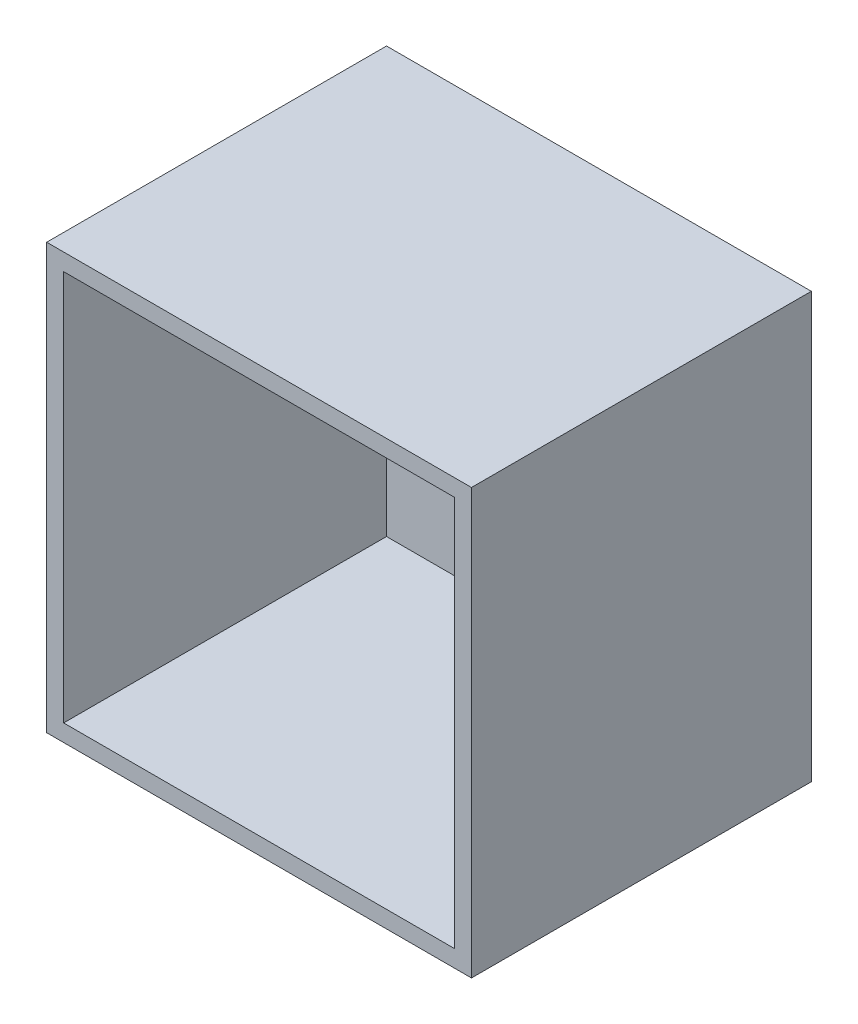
ISO-10303-21;
HEADER;
FILE_DESCRIPTION(('STEP AP214'),'2;1');
FILE_NAME('part.step','',(''),(''),'','','');
FILE_SCHEMA(('AUTOMOTIVE_DESIGN { 1 0 10303 214 1 1 1 1 }'));
ENDSEC;
DATA;
#1=APPLICATION_CONTEXT('core data for automotive mechanical design processes');
#2=APPLICATION_PROTOCOL_DEFINITION('international standard','automotive_design',2000,#1);
#3=PRODUCT_CONTEXT('',#1,'mechanical');
#4=PRODUCT('Part','Part','',(#3));
#5=PRODUCT_RELATED_PRODUCT_CATEGORY('part','',(#4));
#6=PRODUCT_DEFINITION_FORMATION('','',#4);
#7=PRODUCT_DEFINITION_CONTEXT('part definition',#1,'design');
#8=PRODUCT_DEFINITION('design','',#6,#7);
#9=PRODUCT_DEFINITION_SHAPE('','',#8);
#10=(LENGTH_UNIT() NAMED_UNIT(*) SI_UNIT(.MILLI.,.METRE.));
#11=(NAMED_UNIT(*) PLANE_ANGLE_UNIT() SI_UNIT($,.RADIAN.));
#12=(NAMED_UNIT(*) SI_UNIT($,.STERADIAN.) SOLID_ANGLE_UNIT());
#13=UNCERTAINTY_MEASURE_WITH_UNIT(LENGTH_MEASURE(1.E-05),#10,'distance_accuracy_value','');
#14=(GEOMETRIC_REPRESENTATION_CONTEXT(3) GLOBAL_UNCERTAINTY_ASSIGNED_CONTEXT((#13)) GLOBAL_UNIT_ASSIGNED_CONTEXT((#10,
#11,#12)) REPRESENTATION_CONTEXT('',''));
#15=CARTESIAN_POINT('',(0.,0.,0.));
#16=DIRECTION('',(0.,0.,1.));
#17=DIRECTION('',(1.,0.,0.));
#18=AXIS2_PLACEMENT_3D('',#15,#16,#17);
#19=CARTESIAN_POINT('',(-25.,-25.,40.));
#20=DIRECTION('',(1.,0.,0.));
#21=DIRECTION('',(0.,0.,-1.));
#22=AXIS2_PLACEMENT_3D('',#19,#20,#21);
#23=PLANE('',#22);
#24=DIRECTION('',(0.,-1.,0.));
#25=VECTOR('',#24,1.);
#26=CARTESIAN_POINT('',(-25.,-25.,0.));
#27=LINE('',#26,#25);
#28=CARTESIAN_POINT('',(-25.,25.,0.));
#29=VERTEX_POINT('',#28);
#30=CARTESIAN_POINT('',(-25.,-25.,0.));
#31=VERTEX_POINT('',#30);
#32=EDGE_CURVE('E146',#29,#31,#27,.T.);
#33=ORIENTED_EDGE('',*,*,#32,.T.);
#34=DIRECTION('',(0.,0.,-1.));
#35=VECTOR('',#34,1.);
#36=CARTESIAN_POINT('',(-25.,-25.,40.));
#37=LINE('',#36,#35);
#38=CARTESIAN_POINT('',(-25.,-25.,40.));
#39=VERTEX_POINT('',#38);
#40=EDGE_CURVE('E11',#39,#31,#37,.T.);
#41=ORIENTED_EDGE('',*,*,#40,.F.);
#42=DIRECTION('',(0.,-1.,0.));
#43=VECTOR('',#42,1.);
#44=CARTESIAN_POINT('',(-25.,-25.,40.));
#45=LINE('',#44,#43);
#46=CARTESIAN_POINT('',(-25.,25.,40.));
#47=VERTEX_POINT('',#46);
#48=EDGE_CURVE('E139',#47,#39,#45,.T.);
#49=ORIENTED_EDGE('',*,*,#48,.F.);
#50=DIRECTION('',(0.,0.,-1.));
#51=VECTOR('',#50,1.);
#52=CARTESIAN_POINT('',(-25.,25.,40.));
#53=LINE('',#52,#51);
#54=EDGE_CURVE('E145',#47,#29,#53,.T.);
#55=ORIENTED_EDGE('',*,*,#54,.T.);
#56=EDGE_LOOP('',(#33,#41,#49,#55));
#57=FACE_BOUND('',#56,.T.);
#58=ADVANCED_FACE('F32',(#57),#23,.F.);
#59=CARTESIAN_POINT('',(25.,-25.,40.));
#60=DIRECTION('',(0.,1.,0.));
#61=DIRECTION('',(-1.,0.,0.));
#62=AXIS2_PLACEMENT_3D('',#59,#60,#61);
#63=PLANE('',#62);
#64=DIRECTION('',(1.,0.,0.));
#65=VECTOR('',#64,1.);
#66=CARTESIAN_POINT('',(25.,-25.,0.));
#67=LINE('',#66,#65);
#68=CARTESIAN_POINT('',(25.,-25.,0.));
#69=VERTEX_POINT('',#68);
#70=EDGE_CURVE('E149',#31,#69,#67,.T.);
#71=ORIENTED_EDGE('',*,*,#70,.T.);
#72=DIRECTION('',(0.,0.,-1.));
#73=VECTOR('',#72,1.);
#74=CARTESIAN_POINT('',(25.,-25.,40.));
#75=LINE('',#74,#73);
#76=CARTESIAN_POINT('',(25.,-25.,40.));
#77=VERTEX_POINT('',#76);
#78=EDGE_CURVE('E39',#77,#69,#75,.T.);
#79=ORIENTED_EDGE('',*,*,#78,.F.);
#80=DIRECTION('',(1.,0.,0.));
#81=VECTOR('',#80,1.);
#82=CARTESIAN_POINT('',(25.,-25.,40.));
#83=LINE('',#82,#81);
#84=EDGE_CURVE('E83',#39,#77,#83,.T.);
#85=ORIENTED_EDGE('',*,*,#84,.F.);
#86=ORIENTED_EDGE('',*,*,#40,.T.);
#87=EDGE_LOOP('',(#71,#79,#85,#86));
#88=FACE_BOUND('',#87,.T.);
#89=ADVANCED_FACE('F178',(#88),#63,.F.);
#90=CARTESIAN_POINT('',(25.,-25.,40.));
#91=DIRECTION('',(-1.,0.,0.));
#92=DIRECTION('',(0.,0.,1.));
#93=AXIS2_PLACEMENT_3D('',#90,#91,#92);
#94=PLANE('',#93);
#95=DIRECTION('',(0.,1.,0.));
#96=VECTOR('',#95,1.);
#97=CARTESIAN_POINT('',(25.,-25.,0.));
#98=LINE('',#97,#96);
#99=CARTESIAN_POINT('',(25.,25.,0.));
#100=VERTEX_POINT('',#99);
#101=EDGE_CURVE('E151',#69,#100,#98,.T.);
#102=ORIENTED_EDGE('',*,*,#101,.T.);
#103=DIRECTION('',(0.,0.,-1.));
#104=VECTOR('',#103,1.);
#105=CARTESIAN_POINT('',(25.,25.,40.));
#106=LINE('',#105,#104);
#107=CARTESIAN_POINT('',(25.,25.,40.));
#108=VERTEX_POINT('',#107);
#109=EDGE_CURVE('E155',#108,#100,#106,.T.);
#110=ORIENTED_EDGE('',*,*,#109,.F.);
#111=DIRECTION('',(0.,1.,0.));
#112=VECTOR('',#111,1.);
#113=CARTESIAN_POINT('',(25.,-25.,40.));
#114=LINE('',#113,#112);
#115=EDGE_CURVE('E142',#77,#108,#114,.T.);
#116=ORIENTED_EDGE('',*,*,#115,.F.);
#117=ORIENTED_EDGE('',*,*,#78,.T.);
#118=EDGE_LOOP('',(#102,#110,#116,#117));
#119=FACE_BOUND('',#118,.T.);
#120=ADVANCED_FACE('F160',(#119),#94,.F.);
#121=CARTESIAN_POINT('',(25.,25.,40.));
#122=DIRECTION('',(0.,-1.,0.));
#123=DIRECTION('',(1.,0.,0.));
#124=AXIS2_PLACEMENT_3D('',#121,#122,#123);
#125=PLANE('',#124);
#126=DIRECTION('',(-1.,0.,0.));
#127=VECTOR('',#126,1.);
#128=CARTESIAN_POINT('',(25.,25.,0.));
#129=LINE('',#128,#127);
#130=EDGE_CURVE('E76',#100,#29,#129,.T.);
#131=ORIENTED_EDGE('',*,*,#130,.T.);
#132=ORIENTED_EDGE('',*,*,#54,.F.);
#133=DIRECTION('',(-1.,0.,0.));
#134=VECTOR('',#133,1.);
#135=CARTESIAN_POINT('',(25.,25.,40.));
#136=LINE('',#135,#134);
#137=EDGE_CURVE('E55',#108,#47,#136,.T.);
#138=ORIENTED_EDGE('',*,*,#137,.F.);
#139=ORIENTED_EDGE('',*,*,#109,.T.);
#140=EDGE_LOOP('',(#131,#132,#138,#139));
#141=FACE_BOUND('',#140,.T.);
#142=ADVANCED_FACE('F168',(#141),#125,.F.);
#143=CARTESIAN_POINT('',(0.,0.,40.));
#144=DIRECTION('',(0.,0.,1.));
#145=DIRECTION('',(1.,0.,0.));
#146=AXIS2_PLACEMENT_3D('',#143,#144,#145);
#147=PLANE('',#146);
#148=DIRECTION('',(0.,-1.,0.));
#149=VECTOR('',#148,1.);
#150=CARTESIAN_POINT('',(-23.,-25.,40.));
#151=LINE('',#150,#149);
#152=CARTESIAN_POINT('',(-23.,23.,40.));
#153=VERTEX_POINT('',#152);
#154=CARTESIAN_POINT('',(-23.,-23.,40.));
#155=VERTEX_POINT('',#154);
#156=EDGE_CURVE('E128',#153,#155,#151,.T.);
#157=ORIENTED_EDGE('',*,*,#156,.F.);
#158=DIRECTION('',(-1.,0.,0.));
#159=VECTOR('',#158,1.);
#160=CARTESIAN_POINT('',(25.,23.,40.));
#161=LINE('',#160,#159);
#162=CARTESIAN_POINT('',(23.,23.,40.));
#163=VERTEX_POINT('',#162);
#164=EDGE_CURVE('E137',#163,#153,#161,.T.);
#165=ORIENTED_EDGE('',*,*,#164,.F.);
#166=DIRECTION('',(0.,1.,0.));
#167=VECTOR('',#166,1.);
#168=CARTESIAN_POINT('',(23.,-25.,40.));
#169=LINE('',#168,#167);
#170=CARTESIAN_POINT('',(23.,-23.,40.));
#171=VERTEX_POINT('',#170);
#172=EDGE_CURVE('E135',#171,#163,#169,.T.);
#173=ORIENTED_EDGE('',*,*,#172,.F.);
#174=DIRECTION('',(1.,0.,0.));
#175=VECTOR('',#174,1.);
#176=CARTESIAN_POINT('',(25.,-23.,40.));
#177=LINE('',#176,#175);
#178=EDGE_CURVE('E120',#155,#171,#177,.T.);
#179=ORIENTED_EDGE('',*,*,#178,.F.);
#180=EDGE_LOOP('',(#157,#165,#173,#179));
#181=FACE_BOUND('',#180,.T.);
#182=ORIENTED_EDGE('',*,*,#48,.T.);
#183=ORIENTED_EDGE('',*,*,#84,.T.);
#184=ORIENTED_EDGE('',*,*,#115,.T.);
#185=ORIENTED_EDGE('',*,*,#137,.T.);
#186=EDGE_LOOP('',(#182,#183,#184,#185));
#187=FACE_BOUND('',#186,.T.);
#188=ADVANCED_FACE('F170',(#181,#187),#147,.T.);
#189=CARTESIAN_POINT('',(0.,0.,0.));
#190=DIRECTION('',(0.,0.,1.));
#191=DIRECTION('',(1.,0.,0.));
#192=AXIS2_PLACEMENT_3D('',#189,#190,#191);
#193=PLANE('',#192);
#194=ORIENTED_EDGE('',*,*,#32,.F.);
#195=ORIENTED_EDGE('',*,*,#130,.F.);
#196=ORIENTED_EDGE('',*,*,#101,.F.);
#197=ORIENTED_EDGE('',*,*,#70,.F.);
#198=EDGE_LOOP('',(#194,#195,#196,#197));
#199=FACE_BOUND('',#198,.T.);
#200=ADVANCED_FACE('F164',(#199),#193,.F.);
#201=CARTESIAN_POINT('',(-23.,-25.,40.));
#202=DIRECTION('',(1.,0.,0.));
#203=DIRECTION('',(0.,0.,-1.));
#204=AXIS2_PLACEMENT_3D('',#201,#202,#203);
#205=PLANE('',#204);
#206=DIRECTION('',(0.,-1.,0.));
#207=VECTOR('',#206,1.);
#208=CARTESIAN_POINT('',(-23.,-25.,2.));
#209=LINE('',#208,#207);
#210=CARTESIAN_POINT('',(-23.,23.,2.));
#211=VERTEX_POINT('',#210);
#212=CARTESIAN_POINT('',(-23.,-23.,2.));
#213=VERTEX_POINT('',#212);
#214=EDGE_CURVE('E111',#211,#213,#209,.T.);
#215=ORIENTED_EDGE('',*,*,#214,.F.);
#216=DIRECTION('',(0.,0.,-1.));
#217=VECTOR('',#216,1.);
#218=CARTESIAN_POINT('',(-23.,23.,40.));
#219=LINE('',#218,#217);
#220=EDGE_CURVE('E131',#153,#211,#219,.T.);
#221=ORIENTED_EDGE('',*,*,#220,.F.);
#222=ORIENTED_EDGE('',*,*,#156,.T.);
#223=DIRECTION('',(0.,0.,-1.));
#224=VECTOR('',#223,1.);
#225=CARTESIAN_POINT('',(-23.,-23.,40.));
#226=LINE('',#225,#224);
#227=EDGE_CURVE('E123',#155,#213,#226,.T.);
#228=ORIENTED_EDGE('',*,*,#227,.T.);
#229=EDGE_LOOP('',(#215,#221,#222,#228));
#230=FACE_BOUND('',#229,.T.);
#231=ADVANCED_FACE('F205',(#230),#205,.T.);
#232=CARTESIAN_POINT('',(25.,-23.,40.));
#233=DIRECTION('',(0.,1.,0.));
#234=DIRECTION('',(-1.,0.,0.));
#235=AXIS2_PLACEMENT_3D('',#232,#233,#234);
#236=PLANE('',#235);
#237=DIRECTION('',(1.,0.,0.));
#238=VECTOR('',#237,1.);
#239=CARTESIAN_POINT('',(25.,-23.,2.));
#240=LINE('',#239,#238);
#241=CARTESIAN_POINT('',(23.,-23.,2.));
#242=VERTEX_POINT('',#241);
#243=EDGE_CURVE('E105',#213,#242,#240,.T.);
#244=ORIENTED_EDGE('',*,*,#243,.F.);
#245=ORIENTED_EDGE('',*,*,#227,.F.);
#246=ORIENTED_EDGE('',*,*,#178,.T.);
#247=DIRECTION('',(0.,0.,-1.));
#248=VECTOR('',#247,1.);
#249=CARTESIAN_POINT('',(23.,-23.,40.));
#250=LINE('',#249,#248);
#251=EDGE_CURVE('E117',#171,#242,#250,.T.);
#252=ORIENTED_EDGE('',*,*,#251,.T.);
#253=EDGE_LOOP('',(#244,#245,#246,#252));
#254=FACE_BOUND('',#253,.T.);
#255=ADVANCED_FACE('F118',(#254),#236,.T.);
#256=CARTESIAN_POINT('',(23.,-25.,40.));
#257=DIRECTION('',(-1.,0.,0.));
#258=DIRECTION('',(0.,0.,1.));
#259=AXIS2_PLACEMENT_3D('',#256,#257,#258);
#260=PLANE('',#259);
#261=DIRECTION('',(0.,1.,0.));
#262=VECTOR('',#261,1.);
#263=CARTESIAN_POINT('',(23.,-25.,2.));
#264=LINE('',#263,#262);
#265=CARTESIAN_POINT('',(23.,23.,2.));
#266=VERTEX_POINT('',#265);
#267=EDGE_CURVE('E109',#242,#266,#264,.T.);
#268=ORIENTED_EDGE('',*,*,#267,.F.);
#269=ORIENTED_EDGE('',*,*,#251,.F.);
#270=ORIENTED_EDGE('',*,*,#172,.T.);
#271=DIRECTION('',(0.,0.,-1.));
#272=VECTOR('',#271,1.);
#273=CARTESIAN_POINT('',(23.,23.,40.));
#274=LINE('',#273,#272);
#275=EDGE_CURVE('E46',#163,#266,#274,.T.);
#276=ORIENTED_EDGE('',*,*,#275,.T.);
#277=EDGE_LOOP('',(#268,#269,#270,#276));
#278=FACE_BOUND('',#277,.T.);
#279=ADVANCED_FACE('F125',(#278),#260,.T.);
#280=CARTESIAN_POINT('',(25.,23.,40.));
#281=DIRECTION('',(0.,-1.,0.));
#282=DIRECTION('',(1.,0.,0.));
#283=AXIS2_PLACEMENT_3D('',#280,#281,#282);
#284=PLANE('',#283);
#285=DIRECTION('',(-1.,0.,0.));
#286=VECTOR('',#285,1.);
#287=CARTESIAN_POINT('',(25.,23.,2.));
#288=LINE('',#287,#286);
#289=EDGE_CURVE('E126',#266,#211,#288,.T.);
#290=ORIENTED_EDGE('',*,*,#289,.F.);
#291=ORIENTED_EDGE('',*,*,#275,.F.);
#292=ORIENTED_EDGE('',*,*,#164,.T.);
#293=ORIENTED_EDGE('',*,*,#220,.T.);
#294=EDGE_LOOP('',(#290,#291,#292,#293));
#295=FACE_BOUND('',#294,.T.);
#296=ADVANCED_FACE('F235',(#295),#284,.T.);
#297=CARTESIAN_POINT('',(0.,0.,2.));
#298=DIRECTION('',(0.,0.,1.));
#299=DIRECTION('',(1.,0.,0.));
#300=AXIS2_PLACEMENT_3D('',#297,#298,#299);
#301=PLANE('',#300);
#302=ORIENTED_EDGE('',*,*,#214,.T.);
#303=ORIENTED_EDGE('',*,*,#243,.T.);
#304=ORIENTED_EDGE('',*,*,#267,.T.);
#305=ORIENTED_EDGE('',*,*,#289,.T.);
#306=EDGE_LOOP('',(#302,#303,#304,#305));
#307=FACE_BOUND('',#306,.T.);
#308=ADVANCED_FACE('F107',(#307),#301,.T.);
#309=CLOSED_SHELL('',(#58,#89,#120,#142,#188,#200,#231,#255,#279,#296,#308));
#310=MANIFOLD_SOLID_BREP('B2',#309);
#311=ADVANCED_BREP_SHAPE_REPRESENTATION('',(#18,#310),#14);
#312=SHAPE_DEFINITION_REPRESENTATION(#9,#311);
ENDSEC;
END-ISO-10303-21;
